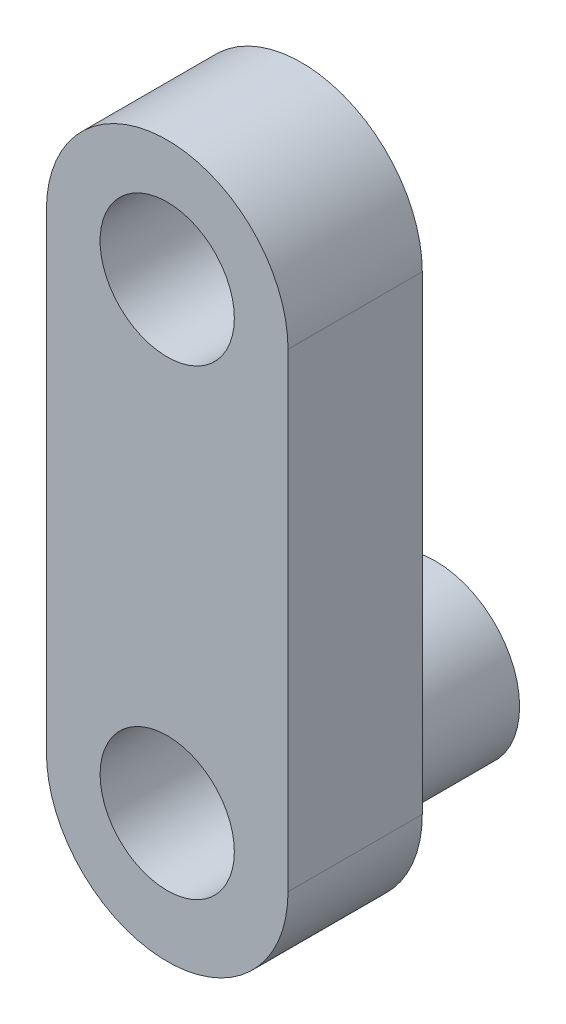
from build123d import *
from build123d.topology import SkipClean

# Parameters (mm, degrees)
SKETCH_1_R      = 10
EXTRUDE_1_DEPTH = 10
EXTRUDE_START   = 20
SKETCH_3_R      = 12.5
SKETCH_3_R_2    = 10
EXTRUDE_2_DEPTH = 20


with BuildPart() as part:
    # Sketch 1 → Extrude 1 (new, symmetric)
    with BuildSketch(Plane.XY):
        with BuildLine():
            Line((18, 70), (18, 0))
            ThreePointArc((18, 0), (0, -18), (-18, 0))
            Line((-18, 0), (-18, 70))
            ThreePointArc((-18, 70), (0, 88), (18, 70))
        make_face()
        with Locations((0, 1.153846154)):
            Circle(SKETCH_1_R, mode=Mode.SUBTRACT)
        with Locations((0, 70)):
            Circle(SKETCH_1_R, mode=Mode.SUBTRACT)
    extrude(amount=EXTRUDE_1_DEPTH, both=True)

    # Sketch 3 → Extrude 2 (add)
    with SkipClean():  # the faces are left unmerged after this step: merging them gives an invalid solid
        with BuildSketch(Plane(origin=(0, 0, -10), x_dir=(-1, 0, 0), z_dir=(0, 0, -1)).offset(EXTRUDE_START)):
            with Locations(Location((0, 1.153846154, 0), (0, 0, 180))):
                Circle(SKETCH_3_R)
            with Locations((0, 1.153846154)):
                Circle(SKETCH_3_R_2, mode=Mode.SUBTRACT)
        extrude(amount=-EXTRUDE_2_DEPTH)


solid = part.part
